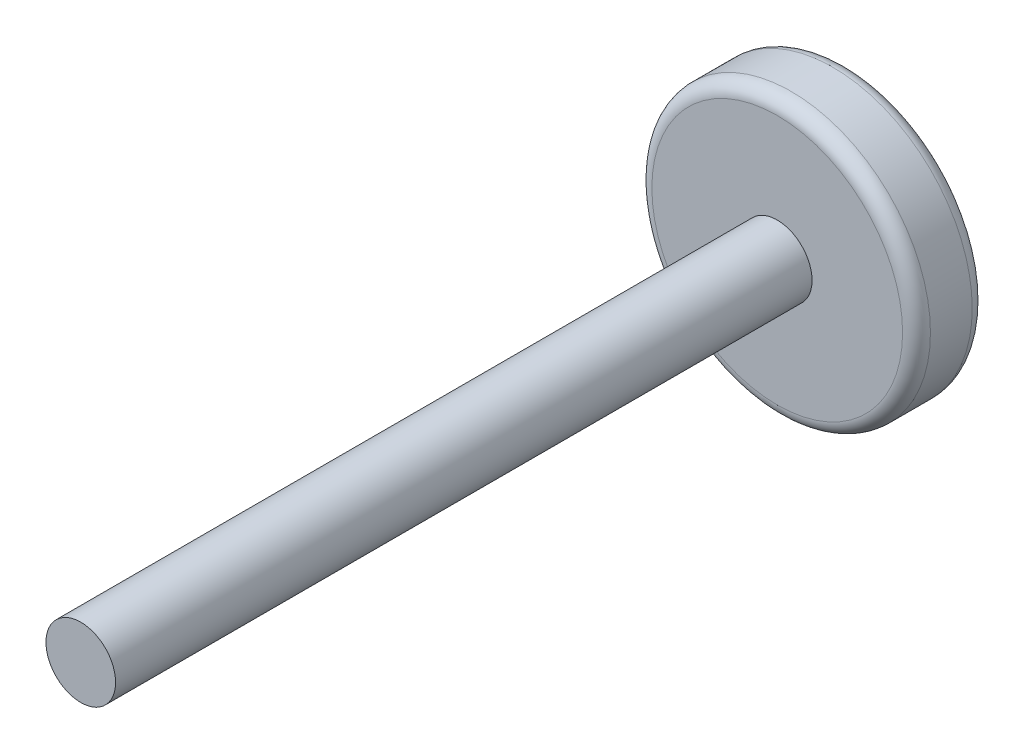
ISO-10303-21;
HEADER;
FILE_DESCRIPTION(('STEP AP214'),'2;1');
FILE_NAME('part.step','',(''),(''),'','','');
FILE_SCHEMA(('AUTOMOTIVE_DESIGN { 1 0 10303 214 1 1 1 1 }'));
ENDSEC;
DATA;
#1=APPLICATION_CONTEXT('core data for automotive mechanical design processes');
#2=APPLICATION_PROTOCOL_DEFINITION('international standard','automotive_design',2000,#1);
#3=PRODUCT_CONTEXT('',#1,'mechanical');
#4=PRODUCT('Part','Part','',(#3));
#5=PRODUCT_RELATED_PRODUCT_CATEGORY('part','',(#4));
#6=PRODUCT_DEFINITION_FORMATION('','',#4);
#7=PRODUCT_DEFINITION_CONTEXT('part definition',#1,'design');
#8=PRODUCT_DEFINITION('design','',#6,#7);
#9=PRODUCT_DEFINITION_SHAPE('','',#8);
#10=(LENGTH_UNIT() NAMED_UNIT(*) SI_UNIT(.MILLI.,.METRE.));
#11=(NAMED_UNIT(*) PLANE_ANGLE_UNIT() SI_UNIT($,.RADIAN.));
#12=(NAMED_UNIT(*) SI_UNIT($,.STERADIAN.) SOLID_ANGLE_UNIT());
#13=UNCERTAINTY_MEASURE_WITH_UNIT(LENGTH_MEASURE(1.E-05),#10,'distance_accuracy_value','');
#14=(GEOMETRIC_REPRESENTATION_CONTEXT(3) GLOBAL_UNCERTAINTY_ASSIGNED_CONTEXT((#13)) GLOBAL_UNIT_ASSIGNED_CONTEXT((#10,
#11,#12)) REPRESENTATION_CONTEXT('',''));
#15=CARTESIAN_POINT('',(0.,0.,0.));
#16=DIRECTION('',(0.,0.,1.));
#17=DIRECTION('',(1.,0.,0.));
#18=AXIS2_PLACEMENT_3D('',#15,#16,#17);
#19=CARTESIAN_POINT('',(0.,0.,5.));
#20=DIRECTION('',(0.,0.,1.));
#21=DIRECTION('',(1.,0.,0.));
#22=AXIS2_PLACEMENT_3D('',#19,#20,#21);
#23=PLANE('',#22);
#24=CARTESIAN_POINT('',(0.,0.,5.));
#25=DIRECTION('',(0.,0.,1.));
#26=DIRECTION('',(1.,0.,0.));
#27=AXIS2_PLACEMENT_3D('',#24,#25,#26);
#28=CIRCLE('',#27,9.);
#29=CARTESIAN_POINT('',(9.,0.,5.));
#30=VERTEX_POINT('',#29);
#31=EDGE_CURVE('E10',#30,#30,#28,.T.);
#32=ORIENTED_EDGE('',*,*,#31,.T.);
#33=EDGE_LOOP('',(#32));
#34=FACE_BOUND('',#33,.T.);
#35=CARTESIAN_POINT('',(0.,0.,5.));
#36=DIRECTION('',(0.,0.,1.));
#37=DIRECTION('',(1.,0.,0.));
#38=AXIS2_PLACEMENT_3D('',#35,#36,#37);
#39=CIRCLE('',#38,2.5);
#40=CARTESIAN_POINT('',(2.5,0.,5.));
#41=VERTEX_POINT('',#40);
#42=EDGE_CURVE('E52',#41,#41,#39,.T.);
#43=ORIENTED_EDGE('',*,*,#42,.F.);
#44=EDGE_LOOP('',(#43));
#45=FACE_BOUND('',#44,.T.);
#46=ADVANCED_FACE('F31',(#34,#45),#23,.T.);
#47=CARTESIAN_POINT('',(0.,0.,5.));
#48=DIRECTION('',(0.,0.,-1.));
#49=DIRECTION('',(-1.,0.,0.));
#50=AXIS2_PLACEMENT_3D('',#47,#48,#49);
#51=CYLINDRICAL_SURFACE('',#50,10.);
#52=CARTESIAN_POINT('',(0.,0.,1.));
#53=DIRECTION('',(0.,0.,1.));
#54=DIRECTION('',(1.,0.,0.));
#55=AXIS2_PLACEMENT_3D('',#52,#53,#54);
#56=CIRCLE('',#55,10.);
#57=CARTESIAN_POINT('',(10.,0.,1.));
#58=VERTEX_POINT('',#57);
#59=EDGE_CURVE('E42',#58,#58,#56,.T.);
#60=ORIENTED_EDGE('',*,*,#59,.T.);
#61=EDGE_LOOP('',(#60));
#62=FACE_BOUND('',#61,.T.);
#63=CARTESIAN_POINT('',(0.,0.,4.));
#64=DIRECTION('',(0.,0.,1.));
#65=DIRECTION('',(1.,0.,0.));
#66=AXIS2_PLACEMENT_3D('',#63,#64,#65);
#67=CIRCLE('',#66,10.);
#68=CARTESIAN_POINT('',(10.,0.,4.));
#69=VERTEX_POINT('',#68);
#70=EDGE_CURVE('E46',#69,#69,#67,.F.);
#71=ORIENTED_EDGE('',*,*,#70,.T.);
#72=EDGE_LOOP('',(#71));
#73=FACE_BOUND('',#72,.T.);
#74=ADVANCED_FACE('F67',(#62,#73),#51,.T.);
#75=CARTESIAN_POINT('',(0.,0.,0.));
#76=DIRECTION('',(0.,0.,1.));
#77=DIRECTION('',(1.,0.,0.));
#78=AXIS2_PLACEMENT_3D('',#75,#76,#77);
#79=PLANE('',#78);
#80=CARTESIAN_POINT('',(0.,0.,0.));
#81=DIRECTION('',(0.,0.,1.));
#82=DIRECTION('',(1.,0.,0.));
#83=AXIS2_PLACEMENT_3D('',#80,#81,#82);
#84=CIRCLE('',#83,9.);
#85=CARTESIAN_POINT('',(9.,0.,0.));
#86=VERTEX_POINT('',#85);
#87=EDGE_CURVE('E38',#86,#86,#84,.F.);
#88=ORIENTED_EDGE('',*,*,#87,.T.);
#89=EDGE_LOOP('',(#88));
#90=FACE_BOUND('',#89,.T.);
#91=ADVANCED_FACE('F72',(#90),#79,.F.);
#92=CARTESIAN_POINT('',(0.,0.,1.));
#93=DIRECTION('',(0.,0.,1.));
#94=DIRECTION('',(1.,0.,0.));
#95=AXIS2_PLACEMENT_3D('',#92,#93,#94);
#96=TOROIDAL_SURFACE('',#95,9.,1.);
#97=ORIENTED_EDGE('',*,*,#87,.F.);
#98=EDGE_LOOP('',(#97));
#99=FACE_BOUND('',#98,.T.);
#100=ORIENTED_EDGE('',*,*,#59,.F.);
#101=EDGE_LOOP('',(#100));
#102=FACE_BOUND('',#101,.T.);
#103=ADVANCED_FACE('F78',(#99,#102),#96,.T.);
#104=CARTESIAN_POINT('',(0.,0.,4.));
#105=DIRECTION('',(0.,0.,1.));
#106=DIRECTION('',(1.,0.,0.));
#107=AXIS2_PLACEMENT_3D('',#104,#105,#106);
#108=TOROIDAL_SURFACE('',#107,9.,1.);
#109=ORIENTED_EDGE('',*,*,#70,.F.);
#110=EDGE_LOOP('',(#109));
#111=FACE_BOUND('',#110,.T.);
#112=ORIENTED_EDGE('',*,*,#31,.F.);
#113=EDGE_LOOP('',(#112));
#114=FACE_BOUND('',#113,.T.);
#115=ADVANCED_FACE('F33',(#111,#114),#108,.T.);
#116=CARTESIAN_POINT('',(0.,0.,55.));
#117=DIRECTION('',(0.,0.,-1.));
#118=DIRECTION('',(-1.,0.,0.));
#119=AXIS2_PLACEMENT_3D('',#116,#117,#118);
#120=CYLINDRICAL_SURFACE('',#119,2.5);
#121=CARTESIAN_POINT('',(0.,0.,55.));
#122=DIRECTION('',(0.,0.,1.));
#123=DIRECTION('',(1.,0.,0.));
#124=AXIS2_PLACEMENT_3D('',#121,#122,#123);
#125=CIRCLE('',#124,2.5);
#126=CARTESIAN_POINT('',(2.5,0.,55.));
#127=VERTEX_POINT('',#126);
#128=EDGE_CURVE('E51',#127,#127,#125,.T.);
#129=ORIENTED_EDGE('',*,*,#128,.F.);
#130=EDGE_LOOP('',(#129));
#131=FACE_BOUND('',#130,.T.);
#132=ORIENTED_EDGE('',*,*,#42,.T.);
#133=EDGE_LOOP('',(#132));
#134=FACE_BOUND('',#133,.T.);
#135=ADVANCED_FACE('F60',(#131,#134),#120,.T.);
#136=CARTESIAN_POINT('',(0.,0.,55.));
#137=DIRECTION('',(0.,0.,1.));
#138=DIRECTION('',(1.,0.,0.));
#139=AXIS2_PLACEMENT_3D('',#136,#137,#138);
#140=PLANE('',#139);
#141=ORIENTED_EDGE('',*,*,#128,.T.);
#142=EDGE_LOOP('',(#141));
#143=FACE_BOUND('',#142,.T.);
#144=ADVANCED_FACE('F58',(#143),#140,.T.);
#145=CLOSED_SHELL('',(#46,#74,#91,#103,#115,#135,#144));
#146=MANIFOLD_SOLID_BREP('B2',#145);
#147=ADVANCED_BREP_SHAPE_REPRESENTATION('',(#18,#146),#14);
#148=SHAPE_DEFINITION_REPRESENTATION(#9,#147);
ENDSEC;
END-ISO-10303-21;
